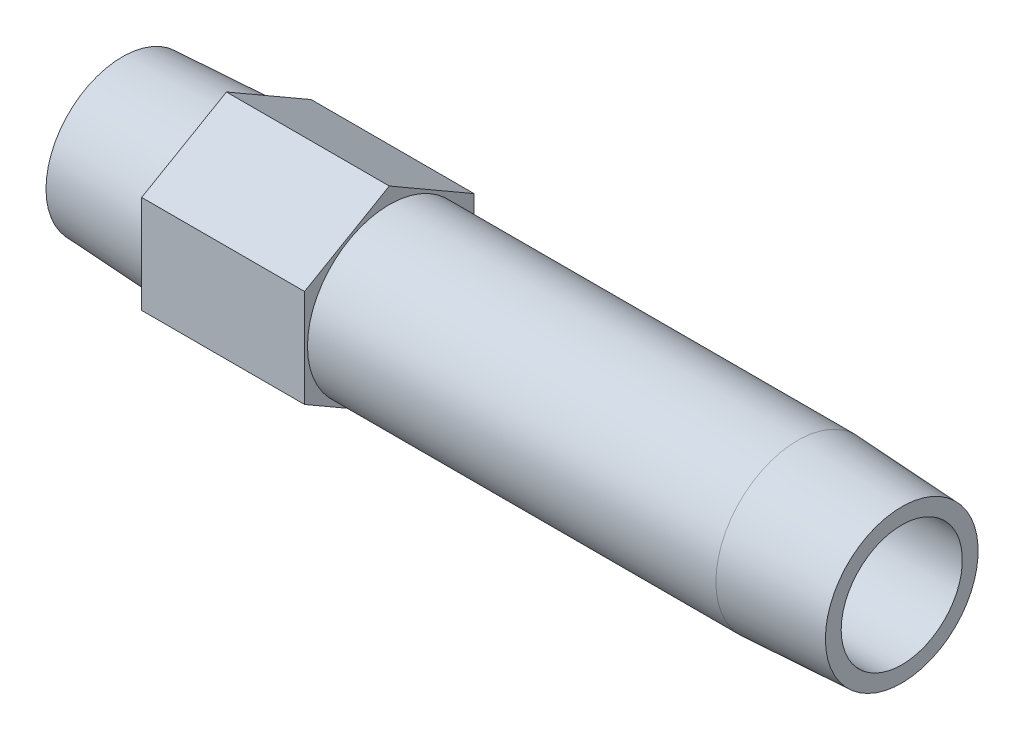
ISO-10303-21;
HEADER;
FILE_DESCRIPTION(('STEP AP214'),'2;1');
FILE_NAME('part.step','',(''),(''),'','','');
FILE_SCHEMA(('AUTOMOTIVE_DESIGN { 1 0 10303 214 1 1 1 1 }'));
ENDSEC;
DATA;
#1=APPLICATION_CONTEXT('core data for automotive mechanical design processes');
#2=APPLICATION_PROTOCOL_DEFINITION('international standard','automotive_design',2000,#1);
#3=PRODUCT_CONTEXT('',#1,'mechanical');
#4=PRODUCT('Part','Part','',(#3));
#5=PRODUCT_RELATED_PRODUCT_CATEGORY('part','',(#4));
#6=PRODUCT_DEFINITION_FORMATION('','',#4);
#7=PRODUCT_DEFINITION_CONTEXT('part definition',#1,'design');
#8=PRODUCT_DEFINITION('design','',#6,#7);
#9=PRODUCT_DEFINITION_SHAPE('','',#8);
#10=(LENGTH_UNIT() NAMED_UNIT(*) SI_UNIT(.MILLI.,.METRE.));
#11=(NAMED_UNIT(*) PLANE_ANGLE_UNIT() SI_UNIT($,.RADIAN.));
#12=(NAMED_UNIT(*) SI_UNIT($,.STERADIAN.) SOLID_ANGLE_UNIT());
#13=UNCERTAINTY_MEASURE_WITH_UNIT(LENGTH_MEASURE(1.E-05),#10,'distance_accuracy_value','');
#14=(GEOMETRIC_REPRESENTATION_CONTEXT(3) GLOBAL_UNCERTAINTY_ASSIGNED_CONTEXT((#13)) GLOBAL_UNIT_ASSIGNED_CONTEXT((#10,
#11,#12)) REPRESENTATION_CONTEXT('',''));
#15=CARTESIAN_POINT('',(0.,0.,0.));
#16=DIRECTION('',(0.,0.,1.));
#17=DIRECTION('',(1.,0.,0.));
#18=AXIS2_PLACEMENT_3D('',#15,#16,#17);
#19=CARTESIAN_POINT('',(0.,0.,-9.95716184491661));
#20=DIRECTION('',(1.,0.,0.));
#21=DIRECTION('',(0.,0.,-1.));
#22=AXIS2_PLACEMENT_3D('',#19,#20,#21);
#23=PLANE('',#22);
#24=CARTESIAN_POINT('',(0.,0.,0.));
#25=DIRECTION('',(-1.,0.,0.));
#26=DIRECTION('',(0.,0.,1.));
#27=AXIS2_PLACEMENT_3D('',#24,#25,#26);
#28=CIRCLE('',#27,9.95716184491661);
#29=CARTESIAN_POINT('',(0.,0.,9.95716184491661));
#30=VERTEX_POINT('',#29);
#31=EDGE_CURVE('E147',#30,#30,#28,.T.);
#32=ORIENTED_EDGE('',*,*,#31,.T.);
#33=EDGE_LOOP('',(#32));
#34=FACE_BOUND('',#33,.T.);
#35=CARTESIAN_POINT('',(0.,0.,0.));
#36=DIRECTION('',(1.,0.,0.));
#37=DIRECTION('',(0.,0.,1.));
#38=AXIS2_PLACEMENT_3D('',#35,#36,#37);
#39=CIRCLE('',#38,7.8994);
#40=CARTESIAN_POINT('',(0.,0.,7.8994));
#41=VERTEX_POINT('',#40);
#42=EDGE_CURVE('E159',#41,#41,#39,.T.);
#43=ORIENTED_EDGE('',*,*,#42,.T.);
#44=EDGE_LOOP('',(#43));
#45=FACE_BOUND('',#44,.T.);
#46=ADVANCED_FACE('F15',(#34,#45),#23,.F.);
#47=CARTESIAN_POINT('',(101.6,0.,-9.95716184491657));
#48=DIRECTION('',(-1.,0.,0.));
#49=DIRECTION('',(0.,0.,1.));
#50=AXIS2_PLACEMENT_3D('',#47,#48,#49);
#51=PLANE('',#50);
#52=CARTESIAN_POINT('',(101.6,0.,0.));
#53=DIRECTION('',(-1.,0.,0.));
#54=DIRECTION('',(0.,0.,1.));
#55=AXIS2_PLACEMENT_3D('',#52,#53,#54);
#56=CIRCLE('',#55,9.95716184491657);
#57=CARTESIAN_POINT('',(101.6,0.,9.95716184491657));
#58=VERTEX_POINT('',#57);
#59=EDGE_CURVE('E150',#58,#58,#56,.T.);
#60=ORIENTED_EDGE('',*,*,#59,.F.);
#61=EDGE_LOOP('',(#60));
#62=FACE_BOUND('',#61,.T.);
#63=CARTESIAN_POINT('',(101.6,0.,0.));
#64=DIRECTION('',(-1.,0.,0.));
#65=DIRECTION('',(0.,0.,1.));
#66=AXIS2_PLACEMENT_3D('',#63,#64,#65);
#67=CIRCLE('',#66,7.8994);
#68=CARTESIAN_POINT('',(101.6,0.,7.8994));
#69=VERTEX_POINT('',#68);
#70=EDGE_CURVE('E156',#69,#69,#67,.F.);
#71=ORIENTED_EDGE('',*,*,#70,.F.);
#72=EDGE_LOOP('',(#71));
#73=FACE_BOUND('',#72,.T.);
#74=ADVANCED_FACE('F178',(#62,#73),#51,.F.);
#75=CARTESIAN_POINT('',(34.798,-6.37914312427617,-11.049));
#76=DIRECTION('',(1.,0.,0.));
#77=DIRECTION('',(0.,1.,0.));
#78=AXIS2_PLACEMENT_3D('',#75,#76,#77);
#79=PLANE('',#78);
#80=DIRECTION('',(0.,0.5,-0.866025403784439));
#81=VECTOR('',#80,1.);
#82=CARTESIAN_POINT('',(34.798,-12.7582862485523,0.));
#83=LINE('',#82,#81);
#84=CARTESIAN_POINT('',(34.798,-12.7582862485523,0.));
#85=VERTEX_POINT('',#84);
#86=CARTESIAN_POINT('',(34.798,-6.37914312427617,-11.049));
#87=VERTEX_POINT('',#86);
#88=EDGE_CURVE('E103',#85,#87,#83,.T.);
#89=ORIENTED_EDGE('',*,*,#88,.T.);
#90=DIRECTION('',(0.,1.,0.));
#91=VECTOR('',#90,1.);
#92=CARTESIAN_POINT('',(34.798,-6.37914312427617,-11.049));
#93=LINE('',#92,#91);
#94=CARTESIAN_POINT('',(34.798,6.37914312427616,-11.049));
#95=VERTEX_POINT('',#94);
#96=EDGE_CURVE('E83',#87,#95,#93,.T.);
#97=ORIENTED_EDGE('',*,*,#96,.T.);
#98=DIRECTION('',(0.,0.5,0.866025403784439));
#99=VECTOR('',#98,1.);
#100=CARTESIAN_POINT('',(34.798,6.37914312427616,-11.049));
#101=LINE('',#100,#99);
#102=CARTESIAN_POINT('',(34.798,12.7582862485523,0.));
#103=VERTEX_POINT('',#102);
#104=EDGE_CURVE('E102',#95,#103,#101,.T.);
#105=ORIENTED_EDGE('',*,*,#104,.T.);
#106=DIRECTION('',(0.,-0.5,0.866025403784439));
#107=VECTOR('',#106,1.);
#108=CARTESIAN_POINT('',(34.798,12.7582862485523,0.));
#109=LINE('',#108,#107);
#110=CARTESIAN_POINT('',(34.798,6.37914312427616,11.049));
#111=VERTEX_POINT('',#110);
#112=EDGE_CURVE('E105',#103,#111,#109,.T.);
#113=ORIENTED_EDGE('',*,*,#112,.T.);
#114=DIRECTION('',(0.,-1.,0.));
#115=VECTOR('',#114,1.);
#116=CARTESIAN_POINT('',(34.798,6.37914312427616,11.049));
#117=LINE('',#116,#115);
#118=CARTESIAN_POINT('',(34.798,-6.37914312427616,11.049));
#119=VERTEX_POINT('',#118);
#120=EDGE_CURVE('E35',#111,#119,#117,.T.);
#121=ORIENTED_EDGE('',*,*,#120,.T.);
#122=DIRECTION('',(0.,-0.5,-0.866025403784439));
#123=VECTOR('',#122,1.);
#124=CARTESIAN_POINT('',(34.798,-6.37914312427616,11.049));
#125=LINE('',#124,#123);
#126=EDGE_CURVE('E30',#119,#85,#125,.T.);
#127=ORIENTED_EDGE('',*,*,#126,.T.);
#128=EDGE_LOOP('',(#89,#97,#105,#113,#121,#127));
#129=FACE_BOUND('',#128,.T.);
#130=CARTESIAN_POINT('',(34.798,0.,0.));
#131=DIRECTION('',(1.,0.,0.));
#132=DIRECTION('',(0.,1.,0.));
#133=AXIS2_PLACEMENT_3D('',#130,#131,#132);
#134=CIRCLE('',#133,10.668);
#135=CARTESIAN_POINT('',(34.798,10.668,0.));
#136=VERTEX_POINT('',#135);
#137=EDGE_CURVE('E89',#136,#136,#134,.F.);
#138=ORIENTED_EDGE('',*,*,#137,.T.);
#139=EDGE_LOOP('',(#138));
#140=FACE_BOUND('',#139,.T.);
#141=ADVANCED_FACE('F124',(#129,#140),#79,.T.);
#142=CARTESIAN_POINT('',(13.5636,-6.37914312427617,-11.049));
#143=DIRECTION('',(1.,0.,0.));
#144=DIRECTION('',(0.,1.,0.));
#145=AXIS2_PLACEMENT_3D('',#142,#143,#144);
#146=PLANE('',#145);
#147=DIRECTION('',(0.,0.5,-0.866025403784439));
#148=VECTOR('',#147,1.);
#149=CARTESIAN_POINT('',(13.5636,-12.7582862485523,0.));
#150=LINE('',#149,#148);
#151=CARTESIAN_POINT('',(13.5636,-12.7582862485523,0.));
#152=VERTEX_POINT('',#151);
#153=CARTESIAN_POINT('',(13.5636,-6.37914312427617,-11.049));
#154=VERTEX_POINT('',#153);
#155=EDGE_CURVE('E73',#152,#154,#150,.T.);
#156=ORIENTED_EDGE('',*,*,#155,.F.);
#157=DIRECTION('',(0.,-0.5,-0.866025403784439));
#158=VECTOR('',#157,1.);
#159=CARTESIAN_POINT('',(13.5636,-6.37914312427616,11.049));
#160=LINE('',#159,#158);
#161=CARTESIAN_POINT('',(13.5636,-6.37914312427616,11.049));
#162=VERTEX_POINT('',#161);
#163=EDGE_CURVE('E99',#162,#152,#160,.T.);
#164=ORIENTED_EDGE('',*,*,#163,.F.);
#165=DIRECTION('',(0.,-1.,0.));
#166=VECTOR('',#165,1.);
#167=CARTESIAN_POINT('',(13.5636,6.37914312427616,11.049));
#168=LINE('',#167,#166);
#169=CARTESIAN_POINT('',(13.5636,6.37914312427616,11.049));
#170=VERTEX_POINT('',#169);
#171=EDGE_CURVE('E133',#170,#162,#168,.T.);
#172=ORIENTED_EDGE('',*,*,#171,.F.);
#173=DIRECTION('',(0.,-0.5,0.866025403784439));
#174=VECTOR('',#173,1.);
#175=CARTESIAN_POINT('',(13.5636,12.7582862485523,0.));
#176=LINE('',#175,#174);
#177=CARTESIAN_POINT('',(13.5636,12.7582862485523,0.));
#178=VERTEX_POINT('',#177);
#179=EDGE_CURVE('E129',#178,#170,#176,.T.);
#180=ORIENTED_EDGE('',*,*,#179,.F.);
#181=DIRECTION('',(0.,0.5,0.866025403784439));
#182=VECTOR('',#181,1.);
#183=CARTESIAN_POINT('',(13.5636,6.37914312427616,-11.049));
#184=LINE('',#183,#182);
#185=CARTESIAN_POINT('',(13.5636,6.37914312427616,-11.049));
#186=VERTEX_POINT('',#185);
#187=EDGE_CURVE('E75',#186,#178,#184,.T.);
#188=ORIENTED_EDGE('',*,*,#187,.F.);
#189=DIRECTION('',(0.,1.,0.));
#190=VECTOR('',#189,1.);
#191=CARTESIAN_POINT('',(13.5636,-6.37914312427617,-11.049));
#192=LINE('',#191,#190);
#193=EDGE_CURVE('E68',#154,#186,#192,.T.);
#194=ORIENTED_EDGE('',*,*,#193,.F.);
#195=EDGE_LOOP('',(#156,#164,#172,#180,#188,#194));
#196=FACE_BOUND('',#195,.T.);
#197=CARTESIAN_POINT('',(13.5636,0.,0.));
#198=DIRECTION('',(-1.,0.,0.));
#199=DIRECTION('',(0.,0.,1.));
#200=AXIS2_PLACEMENT_3D('',#197,#198,#199);
#201=CIRCLE('',#200,10.668);
#202=CARTESIAN_POINT('',(13.5636,0.,10.668));
#203=VERTEX_POINT('',#202);
#204=EDGE_CURVE('E95',#203,#203,#201,.T.);
#205=ORIENTED_EDGE('',*,*,#204,.F.);
#206=EDGE_LOOP('',(#205));
#207=FACE_BOUND('',#206,.T.);
#208=ADVANCED_FACE('F69',(#196,#207),#146,.F.);
#209=CARTESIAN_POINT('',(34.798,-12.7582862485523,0.));
#210=DIRECTION('',(0.,0.866025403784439,0.5));
#211=DIRECTION('',(0.,-0.5,0.866025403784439));
#212=AXIS2_PLACEMENT_3D('',#209,#210,#211);
#213=PLANE('',#212);
#214=ORIENTED_EDGE('',*,*,#155,.T.);
#215=DIRECTION('',(-1.,0.,0.));
#216=VECTOR('',#215,1.);
#217=CARTESIAN_POINT('',(34.798,-6.37914312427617,-11.049));
#218=LINE('',#217,#216);
#219=EDGE_CURVE('E10',#87,#154,#218,.T.);
#220=ORIENTED_EDGE('',*,*,#219,.F.);
#221=ORIENTED_EDGE('',*,*,#88,.F.);
#222=DIRECTION('',(-1.,0.,0.));
#223=VECTOR('',#222,1.);
#224=CARTESIAN_POINT('',(34.798,-12.7582862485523,0.));
#225=LINE('',#224,#223);
#226=EDGE_CURVE('E87',#85,#152,#225,.T.);
#227=ORIENTED_EDGE('',*,*,#226,.T.);
#228=EDGE_LOOP('',(#214,#220,#221,#227));
#229=FACE_BOUND('',#228,.T.);
#230=ADVANCED_FACE('F17',(#229),#213,.F.);
#231=CARTESIAN_POINT('',(34.798,-6.37914312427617,-11.049));
#232=DIRECTION('',(0.,0.,1.));
#233=DIRECTION('',(1.,0.,0.));
#234=AXIS2_PLACEMENT_3D('',#231,#232,#233);
#235=PLANE('',#234);
#236=ORIENTED_EDGE('',*,*,#193,.T.);
#237=DIRECTION('',(-1.,0.,0.));
#238=VECTOR('',#237,1.);
#239=CARTESIAN_POINT('',(34.798,6.37914312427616,-11.049));
#240=LINE('',#239,#238);
#241=EDGE_CURVE('E23',#95,#186,#240,.T.);
#242=ORIENTED_EDGE('',*,*,#241,.F.);
#243=ORIENTED_EDGE('',*,*,#96,.F.);
#244=ORIENTED_EDGE('',*,*,#219,.T.);
#245=EDGE_LOOP('',(#236,#242,#243,#244));
#246=FACE_BOUND('',#245,.T.);
#247=ADVANCED_FACE('F82',(#246),#235,.F.);
#248=CARTESIAN_POINT('',(34.798,6.37914312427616,-11.049));
#249=DIRECTION('',(0.,-0.866025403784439,0.5));
#250=DIRECTION('',(0.,-0.5,-0.866025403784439));
#251=AXIS2_PLACEMENT_3D('',#248,#249,#250);
#252=PLANE('',#251);
#253=ORIENTED_EDGE('',*,*,#187,.T.);
#254=DIRECTION('',(-1.,0.,0.));
#255=VECTOR('',#254,1.);
#256=CARTESIAN_POINT('',(34.798,12.7582862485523,0.));
#257=LINE('',#256,#255);
#258=EDGE_CURVE('E117',#103,#178,#257,.T.);
#259=ORIENTED_EDGE('',*,*,#258,.F.);
#260=ORIENTED_EDGE('',*,*,#104,.F.);
#261=ORIENTED_EDGE('',*,*,#241,.T.);
#262=EDGE_LOOP('',(#253,#259,#260,#261));
#263=FACE_BOUND('',#262,.T.);
#264=ADVANCED_FACE('F121',(#263),#252,.F.);
#265=CARTESIAN_POINT('',(34.798,12.7582862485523,0.));
#266=DIRECTION('',(0.,-0.866025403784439,-0.5));
#267=DIRECTION('',(0.,0.5,-0.866025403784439));
#268=AXIS2_PLACEMENT_3D('',#265,#266,#267);
#269=PLANE('',#268);
#270=ORIENTED_EDGE('',*,*,#179,.T.);
#271=DIRECTION('',(-1.,0.,0.));
#272=VECTOR('',#271,1.);
#273=CARTESIAN_POINT('',(34.798,6.37914312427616,11.049));
#274=LINE('',#273,#272);
#275=EDGE_CURVE('E114',#111,#170,#274,.T.);
#276=ORIENTED_EDGE('',*,*,#275,.F.);
#277=ORIENTED_EDGE('',*,*,#112,.F.);
#278=ORIENTED_EDGE('',*,*,#258,.T.);
#279=EDGE_LOOP('',(#270,#276,#277,#278));
#280=FACE_BOUND('',#279,.T.);
#281=ADVANCED_FACE('F128',(#280),#269,.F.);
#282=CARTESIAN_POINT('',(34.798,6.37914312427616,11.049));
#283=DIRECTION('',(0.,0.,-1.));
#284=DIRECTION('',(-1.,0.,0.));
#285=AXIS2_PLACEMENT_3D('',#282,#283,#284);
#286=PLANE('',#285);
#287=ORIENTED_EDGE('',*,*,#171,.T.);
#288=DIRECTION('',(-1.,0.,0.));
#289=VECTOR('',#288,1.);
#290=CARTESIAN_POINT('',(34.798,-6.37914312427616,11.049));
#291=LINE('',#290,#289);
#292=EDGE_CURVE('E111',#119,#162,#291,.T.);
#293=ORIENTED_EDGE('',*,*,#292,.F.);
#294=ORIENTED_EDGE('',*,*,#120,.F.);
#295=ORIENTED_EDGE('',*,*,#275,.T.);
#296=EDGE_LOOP('',(#287,#293,#294,#295));
#297=FACE_BOUND('',#296,.T.);
#298=ADVANCED_FACE('F132',(#297),#286,.F.);
#299=CARTESIAN_POINT('',(34.798,-6.37914312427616,11.049));
#300=DIRECTION('',(0.,0.866025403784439,-0.5));
#301=DIRECTION('',(0.,0.5,0.866025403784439));
#302=AXIS2_PLACEMENT_3D('',#299,#300,#301);
#303=PLANE('',#302);
#304=ORIENTED_EDGE('',*,*,#163,.T.);
#305=ORIENTED_EDGE('',*,*,#226,.F.);
#306=ORIENTED_EDGE('',*,*,#126,.F.);
#307=ORIENTED_EDGE('',*,*,#292,.T.);
#308=EDGE_LOOP('',(#304,#305,#306,#307));
#309=FACE_BOUND('',#308,.T.);
#310=ADVANCED_FACE('F135',(#309),#303,.F.);
#311=CARTESIAN_POINT('',(13.5636,0.,0.));
#312=DIRECTION('',(1.,0.,0.));
#313=DIRECTION('',(0.,0.,-1.));
#314=AXIS2_PLACEMENT_3D('',#311,#312,#313);
#315=CONICAL_SURFACE('',#314,10.668,0.0523598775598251);
#316=ORIENTED_EDGE('',*,*,#31,.F.);
#317=EDGE_LOOP('',(#316));
#318=FACE_BOUND('',#317,.T.);
#319=ORIENTED_EDGE('',*,*,#204,.T.);
#320=EDGE_LOOP('',(#319));
#321=FACE_BOUND('',#320,.T.);
#322=ADVANCED_FACE('F187',(#318,#321),#315,.T.);
#323=CARTESIAN_POINT('',(-60.,0.,0.));
#324=DIRECTION('',(-1.,0.,0.));
#325=DIRECTION('',(0.,0.,1.));
#326=AXIS2_PLACEMENT_3D('',#323,#324,#325);
#327=CYLINDRICAL_SURFACE('',#326,10.668);
#328=ORIENTED_EDGE('',*,*,#137,.F.);
#329=EDGE_LOOP('',(#328));
#330=FACE_BOUND('',#329,.T.);
#331=CARTESIAN_POINT('',(88.0364,0.,0.));
#332=DIRECTION('',(-1.,0.,0.));
#333=DIRECTION('',(0.,0.,1.));
#334=AXIS2_PLACEMENT_3D('',#331,#332,#333);
#335=CIRCLE('',#334,10.668);
#336=CARTESIAN_POINT('',(88.0364,0.,10.668));
#337=VERTEX_POINT('',#336);
#338=EDGE_CURVE('E153',#337,#337,#335,.T.);
#339=ORIENTED_EDGE('',*,*,#338,.T.);
#340=EDGE_LOOP('',(#339));
#341=FACE_BOUND('',#340,.T.);
#342=ADVANCED_FACE('F174',(#330,#341),#327,.T.);
#343=CARTESIAN_POINT('',(101.6,0.,0.));
#344=DIRECTION('',(-1.,0.,0.));
#345=DIRECTION('',(0.,0.,1.));
#346=AXIS2_PLACEMENT_3D('',#343,#344,#345);
#347=CONICAL_SURFACE('',#346,9.95716184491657,0.052359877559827);
#348=ORIENTED_EDGE('',*,*,#338,.F.);
#349=EDGE_LOOP('',(#348));
#350=FACE_BOUND('',#349,.T.);
#351=ORIENTED_EDGE('',*,*,#59,.T.);
#352=EDGE_LOOP('',(#351));
#353=FACE_BOUND('',#352,.T.);
#354=ADVANCED_FACE('F167',(#350,#353),#347,.T.);
#355=CARTESIAN_POINT('',(107.060623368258,0.,0.));
#356=DIRECTION('',(-1.,0.,0.));
#357=DIRECTION('',(0.,0.,1.));
#358=AXIS2_PLACEMENT_3D('',#355,#356,#357);
#359=CYLINDRICAL_SURFACE('',#358,7.8994);
#360=ORIENTED_EDGE('',*,*,#70,.T.);
#361=EDGE_LOOP('',(#360));
#362=FACE_BOUND('',#361,.T.);
#363=ORIENTED_EDGE('',*,*,#42,.F.);
#364=EDGE_LOOP('',(#363));
#365=FACE_BOUND('',#364,.T.);
#366=ADVANCED_FACE('F165',(#362,#365),#359,.F.);
#367=CLOSED_SHELL('',(#46,#74,#141,#208,#230,#247,#264,#281,#298,#310,#322,#342,#354,#366));
#368=MANIFOLD_SOLID_BREP('B1',#367);
#369=ADVANCED_BREP_SHAPE_REPRESENTATION('',(#18,#368),#14);
#370=SHAPE_DEFINITION_REPRESENTATION(#9,#369);
ENDSEC;
END-ISO-10303-21;
